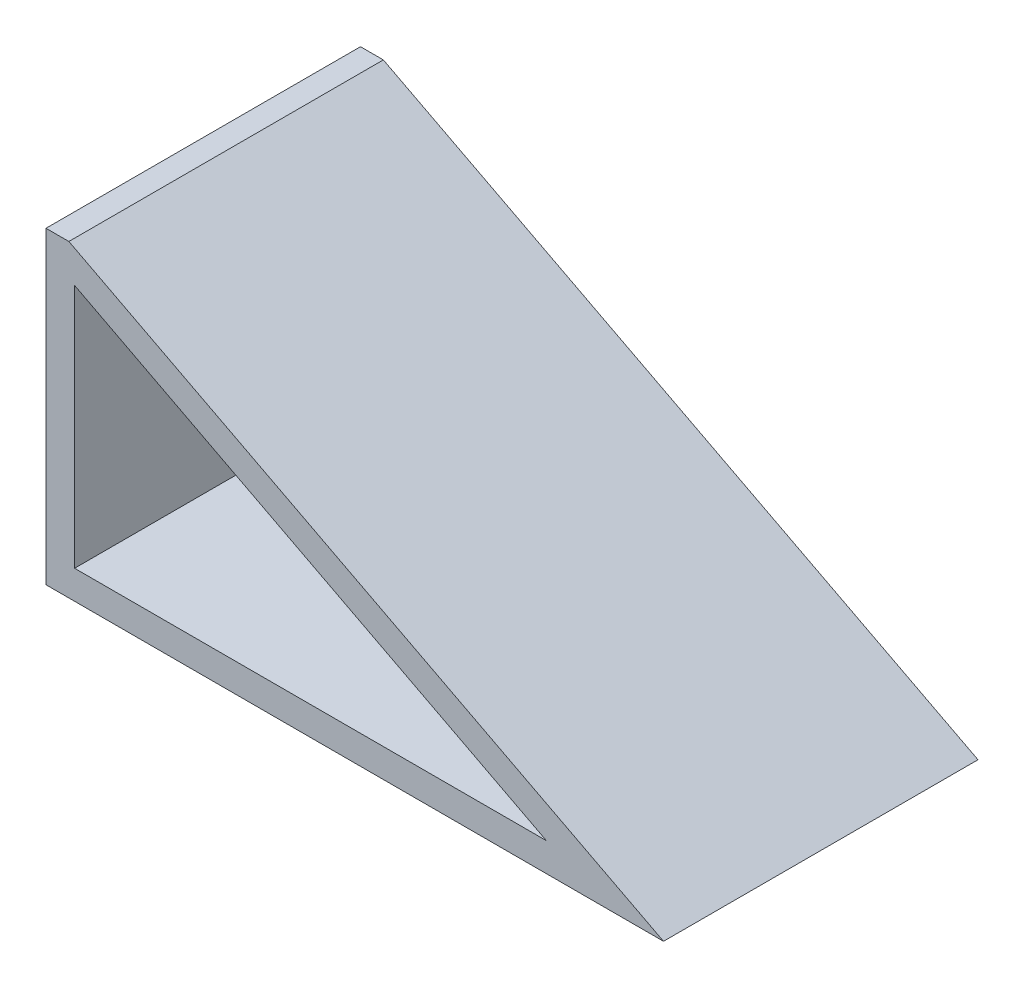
from build123d import *

# Parameters (mm, degrees)
BOSS_EXTRUDE1_DEPTH = 34.925
SHELL1_T            = -6.35
SKETCH2_R           = 4.064
CUT_EXTRUDE1_DEPTH  = 3.048


with BuildPart() as part:
    # Sketch1 → Boss-Extrude1 (new, symmetric)
    with BuildSketch(Plane.XY):
        Polygon((0, 0), (0, 68.58), (5.08, 68.58), (137.16, 0), align=None)
    extrude(amount=BOSS_EXTRUDE1_DEPTH, both=True)

    # Shell1
    shell1_openings = [part.faces().sort_by_distance(p)[0] for p in [
        (45.78047619, 23.676428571, 34.925),
        (45.78047619, 23.676428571, -34.925),
    ]]
    offset(amount=SHELL1_T, openings=shell1_openings)

    # Sketch2 → Cut-Extrude1 (cut)
    with BuildSketch(Plane.ZY):
        with Locations((-17.4625, 31.75)):
            Circle(SKETCH2_R)
        with Locations((17.4625, 31.75)):
            Circle(SKETCH2_R)
    extrude(amount=-CUT_EXTRUDE1_DEPTH, mode=Mode.SUBTRACT)


solid = part.part
